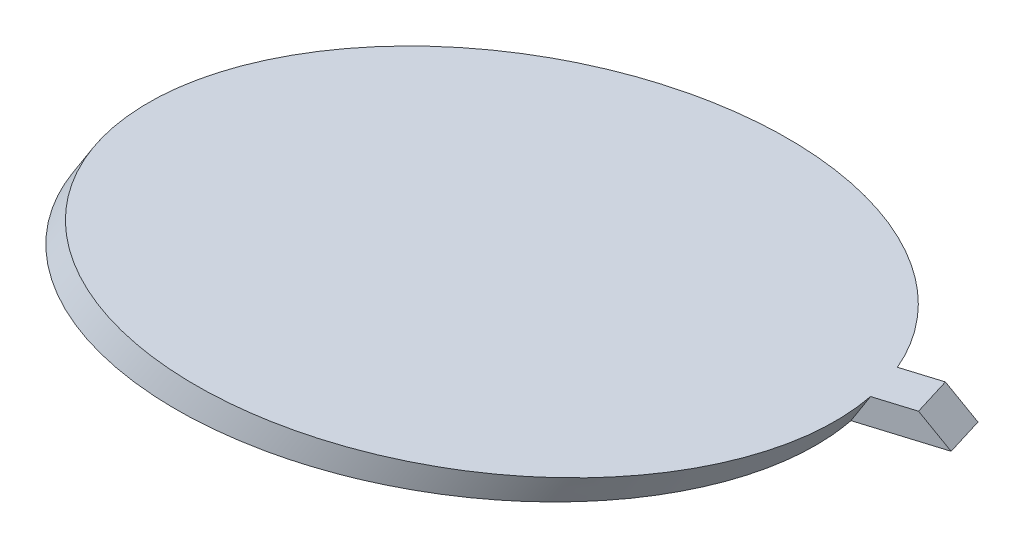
ISO-10303-21;
HEADER;
FILE_DESCRIPTION(('STEP AP214'),'2;1');
FILE_NAME('part.step','',(''),(''),'','','');
FILE_SCHEMA(('AUTOMOTIVE_DESIGN { 1 0 10303 214 1 1 1 1 }'));
ENDSEC;
DATA;
#1=APPLICATION_CONTEXT('core data for automotive mechanical design processes');
#2=APPLICATION_PROTOCOL_DEFINITION('international standard','automotive_design',2000,#1);
#3=PRODUCT_CONTEXT('',#1,'mechanical');
#4=PRODUCT('Part','Part','',(#3));
#5=PRODUCT_RELATED_PRODUCT_CATEGORY('part','',(#4));
#6=PRODUCT_DEFINITION_FORMATION('','',#4);
#7=PRODUCT_DEFINITION_CONTEXT('part definition',#1,'design');
#8=PRODUCT_DEFINITION('design','',#6,#7);
#9=PRODUCT_DEFINITION_SHAPE('','',#8);
#10=(LENGTH_UNIT() NAMED_UNIT(*) SI_UNIT(.MILLI.,.METRE.));
#11=(NAMED_UNIT(*) PLANE_ANGLE_UNIT() SI_UNIT($,.RADIAN.));
#12=(NAMED_UNIT(*) SI_UNIT($,.STERADIAN.) SOLID_ANGLE_UNIT());
#13=UNCERTAINTY_MEASURE_WITH_UNIT(LENGTH_MEASURE(1.E-05),#10,'distance_accuracy_value','');
#14=(GEOMETRIC_REPRESENTATION_CONTEXT(3) GLOBAL_UNCERTAINTY_ASSIGNED_CONTEXT((#13)) GLOBAL_UNIT_ASSIGNED_CONTEXT((#10,
#11,#12)) REPRESENTATION_CONTEXT('',''));
#15=CARTESIAN_POINT('',(0.,0.,0.));
#16=DIRECTION('',(0.,0.,1.));
#17=DIRECTION('',(1.,0.,0.));
#18=AXIS2_PLACEMENT_3D('',#15,#16,#17);
#19=CARTESIAN_POINT('',(28.7104895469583,-2.57197650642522,-6.73070158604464));
#20=CARTESIAN_POINT('',(29.0588682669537,-2.57197650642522,-4.95726979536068));
#21=CARTESIAN_POINT('',(29.1561157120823,-2.57197650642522,-3.17728620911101));
#22=CARTESIAN_POINT('',(28.9609887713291,-2.57197650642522,-0.498414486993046));
#23=CARTESIAN_POINT('',(28.8367475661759,-2.57197650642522,0.40063205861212));
#24=CARTESIAN_POINT('',(28.4825121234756,-2.57197650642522,2.15523290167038));
#25=CARTESIAN_POINT('',(28.2530117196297,-2.57197650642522,3.01589589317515));
#26=CARTESIAN_POINT('',(27.6991348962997,-2.57197650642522,4.70708800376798));
#27=CARTESIAN_POINT('',(27.3747037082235,-2.57197650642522,5.53759972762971));
#28=CARTESIAN_POINT('',(26.6357040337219,-2.57197650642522,7.16999438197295));
#29=CARTESIAN_POINT('',(26.2198064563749,-2.57197650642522,7.97301414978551));
#30=CARTESIAN_POINT('',(24.8712829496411,-2.57197650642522,10.2893901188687));
#31=CARTESIAN_POINT('',(23.8301632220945,-2.57197650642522,11.7288086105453));
#32=CARTESIAN_POINT('',(22.0849902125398,-2.57197650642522,13.7525706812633));
#33=CARTESIAN_POINT('',(21.4718438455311,-2.57197650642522,14.4051438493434));
#34=CARTESIAN_POINT('',(20.1887069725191,-2.57197650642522,15.6635424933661));
#35=CARTESIAN_POINT('',(19.5264342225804,-2.57197650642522,16.2619388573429));
#36=CARTESIAN_POINT('',(17.4821643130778,-2.57197650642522,17.9716539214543));
#37=CARTESIAN_POINT('',(16.0426543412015,-2.57197650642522,18.9974076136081));
#38=CARTESIAN_POINT('',(13.7779850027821,-2.57197650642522,20.3792221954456));
#39=CARTESIAN_POINT('',(13.005539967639,-2.57197650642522,20.8137091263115));
#40=CARTESIAN_POINT('',(11.426083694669,-2.57197650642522,21.6312569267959));
#41=CARTESIAN_POINT('',(10.6174855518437,-2.57197650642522,22.0149975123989));
#42=CARTESIAN_POINT('',(8.14939755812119,-2.57197650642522,23.0834767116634));
#43=CARTESIAN_POINT('',(6.47196864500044,-2.57197650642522,23.6761837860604));
#44=CARTESIAN_POINT('',(3.05449574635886,-2.57197650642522,24.6278195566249));
#45=CARTESIAN_POINT('',(1.31473329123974,-2.57197650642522,24.9877993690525));
#46=CARTESIAN_POINT('',(-1.34297683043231,-2.57197650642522,25.3483091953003));
#47=CARTESIAN_POINT('',(-2.237995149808,-2.57197650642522,25.4381765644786));
#48=CARTESIAN_POINT('',(-4.02023728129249,-2.57197650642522,25.5530995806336));
#49=CARTESIAN_POINT('',(-4.91040260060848,-2.57197650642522,25.5786579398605));
#50=CARTESIAN_POINT('',(-7.57793617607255,-2.57197650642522,25.5564476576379));
#51=CARTESIAN_POINT('',(-9.35235836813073,-2.57197650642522,25.4103383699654));
#52=CARTESIAN_POINT('',(-12.0075237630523,-2.57197650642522,24.9752739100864));
#53=CARTESIAN_POINT('',(-12.8866571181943,-2.57197650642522,24.7945497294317));
#54=CARTESIAN_POINT('',(-14.6174949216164,-2.57197650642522,24.361866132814));
#55=CARTESIAN_POINT('',(-15.4714792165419,-2.57197650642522,24.109572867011));
#56=CARTESIAN_POINT('',(-17.1549785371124,-2.57197650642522,23.5280526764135));
#57=CARTESIAN_POINT('',(-17.9844334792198,-2.57197650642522,23.1986368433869));
#58=CARTESIAN_POINT('',(-19.2085237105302,-2.57197650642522,22.641341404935));
#59=CARTESIAN_POINT('',(-19.6138984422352,-2.57197650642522,22.444662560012));
#60=CARTESIAN_POINT('',(-20.4105539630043,-2.57197650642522,22.0330275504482));
#61=CARTESIAN_POINT('',(-20.802573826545,-2.57197650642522,21.817777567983));
#62=CARTESIAN_POINT('',(-21.9593651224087,-2.57197650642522,21.1432148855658));
#63=CARTESIAN_POINT('',(-22.704951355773,-2.57197650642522,20.6552137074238));
#64=CARTESIAN_POINT('',(-23.7822036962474,-2.57197650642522,19.8617129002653));
#65=CARTESIAN_POINT('',(-24.1344139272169,-2.57197650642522,19.5869338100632));
#66=CARTESIAN_POINT('',(-24.8243562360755,-2.57197650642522,19.0157258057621));
#67=CARTESIAN_POINT('',(-25.163009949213,-2.57197650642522,18.7184209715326));
#68=CARTESIAN_POINT('',(-26.8057802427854,-2.57197650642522,17.1854475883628));
#69=CARTESIAN_POINT('',(-27.9502422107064,-2.57197650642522,15.821238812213));
#70=CARTESIAN_POINT('',(-29.1516319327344,-2.57197650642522,13.9298914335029));
#71=CARTESIAN_POINT('',(-29.3810848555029,-2.57197650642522,13.5406664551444));
#72=CARTESIAN_POINT('',(-29.8104566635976,-2.57197650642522,12.7523271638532));
#73=CARTESIAN_POINT('',(-30.0106847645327,-2.57197650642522,12.3529808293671));
#74=CARTESIAN_POINT('',(-30.5683411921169,-2.57197650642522,11.1395354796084));
#75=CARTESIAN_POINT('',(-30.8829111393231,-2.57197650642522,10.3100908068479));
#76=CARTESIAN_POINT('',(-31.2672265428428,-2.57197650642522,9.03457983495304));
#77=CARTESIAN_POINT('',(-31.380722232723,-2.57197650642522,8.60417852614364));
#78=CARTESIAN_POINT('',(-31.5783521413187,-2.57197650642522,7.73286288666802));
#79=CARTESIAN_POINT('',(-31.66266373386,-2.57197650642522,7.2907720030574));
#80=CARTESIAN_POINT('',(-31.8696222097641,-2.57197650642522,5.95628902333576));
#81=CARTESIAN_POINT('',(-31.9447911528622,-2.57197650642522,5.06927081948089));
#82=CARTESIAN_POINT('',(-31.9976453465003,-2.57197650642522,2.41546589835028));
#83=CARTESIAN_POINT('',(-31.8043263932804,-2.57197650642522,0.655859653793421));
#84=CARTESIAN_POINT('',(-31.184725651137,-2.57197650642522,-1.96970886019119));
#85=CARTESIAN_POINT('',(-30.9268669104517,-2.57197650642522,-2.82678704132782));
#86=CARTESIAN_POINT('',(-30.322491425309,-2.57197650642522,-4.49889521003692));
#87=CARTESIAN_POINT('',(-29.9754968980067,-2.57197650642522,-5.31564473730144));
#88=CARTESIAN_POINT('',(-29.1981313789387,-2.57197650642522,-6.9132218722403));
#89=CARTESIAN_POINT('',(-28.7677283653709,-2.57197650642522,-7.69403568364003));
#90=CARTESIAN_POINT('',(-28.0614035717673,-2.57197650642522,-8.83909567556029));
#91=CARTESIAN_POINT('',(-27.8161678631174,-2.57197650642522,-9.21572290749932));
#92=CARTESIAN_POINT('',(-27.3110140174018,-2.57197650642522,-9.95277050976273));
#93=CARTESIAN_POINT('',(-27.0505237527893,-2.57197650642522,-10.3141489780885));
#94=CARTESIAN_POINT('',(-25.7107067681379,-2.57197650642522,-12.087302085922));
#95=CARTESIAN_POINT('',(-24.5207779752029,-2.57197650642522,-13.3992088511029));
#96=CARTESIAN_POINT('',(-22.5801113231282,-2.57197650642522,-15.2264137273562));
#97=CARTESIAN_POINT('',(-21.9064343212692,-2.57197650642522,-15.8122025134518));
#98=CARTESIAN_POINT('',(-20.5093296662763,-2.57197650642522,-16.9351351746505));
#99=CARTESIAN_POINT('',(-19.7939039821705,-2.57197650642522,-17.4658752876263));
#100=CARTESIAN_POINT('',(-17.5999323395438,-2.57197650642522,-18.9712442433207));
#101=CARTESIAN_POINT('',(-16.0744961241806,-2.57197650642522,-19.860486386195));
#102=CARTESIAN_POINT('',(-13.699787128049,-2.57197650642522,-21.0367343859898));
#103=CARTESIAN_POINT('',(-12.8936656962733,-2.57197650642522,-21.4023184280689));
#104=CARTESIAN_POINT('',(-11.2522050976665,-2.57197650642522,-22.0802813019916));
#105=CARTESIAN_POINT('',(-10.4148265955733,-2.57197650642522,-22.3933347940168));
#106=CARTESIAN_POINT('',(-7.87117200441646,-2.57197650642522,-23.2453777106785));
#107=CARTESIAN_POINT('',(-6.15263868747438,-2.57197650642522,-23.6913209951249));
#108=CARTESIAN_POINT('',(-2.67175819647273,-2.57197650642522,-24.3482257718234));
#109=CARTESIAN_POINT('',(-0.909473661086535,-2.57197650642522,-24.5595232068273));
#110=CARTESIAN_POINT('',(1.76934187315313,-2.57197650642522,-24.6866730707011));
#111=CARTESIAN_POINT('',(2.66495441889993,-2.57197650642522,-24.696794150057));
#112=CARTESIAN_POINT('',(4.44432938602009,-2.57197650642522,-24.6499905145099));
#113=CARTESIAN_POINT('',(5.33061237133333,-2.57197650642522,-24.5932857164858));
#114=CARTESIAN_POINT('',(7.09623439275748,-2.57197650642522,-24.411950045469));
#115=CARTESIAN_POINT('',(7.97557503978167,-2.57197650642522,-24.2873349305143));
#116=CARTESIAN_POINT('',(9.28909667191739,-2.57197650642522,-24.0467152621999));
#117=CARTESIAN_POINT('',(9.72602029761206,-2.57197650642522,-23.9575393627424));
#118=CARTESIAN_POINT('',(10.597958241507,-2.57197650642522,-23.7605106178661));
#119=CARTESIAN_POINT('',(11.0336715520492,-2.57197650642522,-23.6524425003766));
#120=CARTESIAN_POINT('',(13.1914166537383,-2.57197650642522,-23.0675557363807));
#121=CARTESIAN_POINT('',(14.8606610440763,-2.57197650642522,-22.4564010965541));
#122=CARTESIAN_POINT('',(16.8662771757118,-2.57197650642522,-21.4888786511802));
#123=CARTESIAN_POINT('',(17.263346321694,-2.57197650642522,-21.285177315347));
#124=CARTESIAN_POINT('',(18.0490099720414,-2.57197650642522,-20.8564591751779));
#125=CARTESIAN_POINT('',(18.4380680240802,-2.57197650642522,-20.6310919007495));
#126=CARTESIAN_POINT('',(19.5806033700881,-2.57197650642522,-19.9284814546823));
#127=CARTESIAN_POINT('',(20.3131609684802,-2.57197650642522,-19.4230057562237));
#128=CARTESIAN_POINT('',(21.716817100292,-2.57197650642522,-18.3338530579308));
#129=CARTESIAN_POINT('',(22.3879515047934,-2.57197650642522,-17.7502217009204));
#130=CARTESIAN_POINT('',(23.3437649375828,-2.57197650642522,-16.8100239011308));
#131=CARTESIAN_POINT('',(23.6548392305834,-2.57197650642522,-16.4845928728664));
#132=CARTESIAN_POINT('',(24.2532798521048,-2.57197650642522,-15.8174184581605));
#133=CARTESIAN_POINT('',(24.5405322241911,-2.57197650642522,-15.476005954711));
#134=CARTESIAN_POINT('',(25.9171505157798,-2.57197650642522,-13.7299451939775));
#135=CARTESIAN_POINT('',(26.8307366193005,-2.57197650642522,-12.2103624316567));
#136=CARTESIAN_POINT('',(27.5354827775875,-2.57197650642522,-10.5542286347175));
#137=B_SPLINE_CURVE_WITH_KNOTS('',3,(#19,#20,#21,#22,#23,#24,#25,#26,#27,#28,#29,#30,#31,#32,
#33,#34,#35,#36,#37,#38,#39,#40,#41,#42,#43,#44,#45,#46,#47,#48,#49,#50,#51,#52,#53,#54,#55,#56,
#57,#58,#59,#60,#61,#62,#63,#64,#65,#66,#67,#68,#69,#70,#71,#72,#73,#74,#75,#76,#77,#78,#79,#80,
#81,#82,#83,#84,#85,#86,#87,#88,#89,#90,#91,#92,#93,#94,#95,#96,#97,#98,#99,#100,#101,#102,#103,
#104,#105,#106,#107,#108,#109,#110,#111,#112,#113,#114,#115,#116,#117,#118,#119,#120,#121,#122,
#123,#124,#125,#126,#127,#128,#129,#130,#131,#132,#133,#134,#135,#136),.UNSPECIFIED.,.F.,.F.,(4,
2,2,2,2,2,2,2,2,2,2,2,2,2,2,2,2,2,2,2,2,2,2,2,2,2,2,2,2,2,2,2,2,2,2,2,2,2,2,2,2,2,2,2,2,2,2,2,2,
2,2,2,2,2,2,2,2,2,4),(0.,0.0312499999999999,0.0468749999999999,0.0624999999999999,
0.0781249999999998,0.0937499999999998,0.125,0.140625,0.15625,0.1875,0.203124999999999,
0.218749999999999,0.249999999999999,0.281249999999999,0.296874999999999,0.312499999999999,
0.343749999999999,0.359374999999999,0.374999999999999,0.390624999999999,0.398437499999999,
0.406249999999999,0.421874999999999,0.429687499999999,0.437499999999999,0.468749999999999,
0.476562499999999,0.484374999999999,0.499999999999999,0.507812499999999,0.515624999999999,
0.531249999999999,0.562499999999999,0.578124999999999,0.593749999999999,0.609374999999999,
0.617187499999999,0.624999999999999,0.65625,0.671875,0.6875,0.71875,0.734375,0.75,0.78125,
0.8125,0.828125,0.84375,0.859375,0.8671875,0.875,0.90625,0.9140625,0.921875,0.9375,0.953125,
0.9609375,0.96875,1.),.UNSPECIFIED.);
#138=DIRECTION('',(0.492063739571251,0.857325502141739,-0.151215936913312));
#139=VECTOR('',#138,1.);
#140=SURFACE_OF_LINEAR_EXTRUSION('',#137,#139);
#141=CARTESIAN_POINT('',(30.186680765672,0.,-7.18434939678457));
#142=CARTESIAN_POINT('',(30.5350594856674,0.,-5.41091760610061));
#143=CARTESIAN_POINT('',(30.6323069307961,0.,-3.63093401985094));
#144=CARTESIAN_POINT('',(30.4371799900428,0.,-0.952062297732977));
#145=CARTESIAN_POINT('',(30.3129387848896,0.,-0.0530157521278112));
#146=CARTESIAN_POINT('',(29.9587033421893,0.,1.70158509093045));
#147=CARTESIAN_POINT('',(29.7292029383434,0.,2.56224808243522));
#148=CARTESIAN_POINT('',(29.1753261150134,0.,4.25344019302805));
#149=CARTESIAN_POINT('',(28.8508949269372,0.,5.08395191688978));
#150=CARTESIAN_POINT('',(28.1118952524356,0.,6.71634657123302));
#151=CARTESIAN_POINT('',(27.6959976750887,0.,7.51936633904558));
#152=CARTESIAN_POINT('',(26.3474741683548,0.,9.83574230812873));
#153=CARTESIAN_POINT('',(25.3063544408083,0.,11.2751607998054));
#154=CARTESIAN_POINT('',(23.5611814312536,0.,13.2989228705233));
#155=CARTESIAN_POINT('',(22.9480350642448,0.,13.9514960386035));
#156=CARTESIAN_POINT('',(21.6648981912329,0.,15.2098946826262));
#157=CARTESIAN_POINT('',(21.0026254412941,0.,15.8082910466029));
#158=CARTESIAN_POINT('',(18.9583555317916,0.,17.5180061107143));
#159=CARTESIAN_POINT('',(17.5188455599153,0.,18.5437598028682));
#160=CARTESIAN_POINT('',(15.2541762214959,0.,19.9255743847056));
#161=CARTESIAN_POINT('',(14.4817311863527,0.,20.3600613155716));
#162=CARTESIAN_POINT('',(12.9022749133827,0.,21.177609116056));
#163=CARTESIAN_POINT('',(12.0936767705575,0.,21.561349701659));
#164=CARTESIAN_POINT('',(9.62558877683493,0.,22.6298289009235));
#165=CARTESIAN_POINT('',(7.94815986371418,0.,23.2225359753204));
#166=CARTESIAN_POINT('',(4.53068696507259,0.,24.174171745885));
#167=CARTESIAN_POINT('',(2.79092450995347,0.,24.5341515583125));
#168=CARTESIAN_POINT('',(0.133214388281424,0.,24.8946613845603));
#169=CARTESIAN_POINT('',(-0.761803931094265,0.,24.9845287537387));
#170=CARTESIAN_POINT('',(-2.54404606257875,0.,25.0994517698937));
#171=CARTESIAN_POINT('',(-3.43421138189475,0.,25.1250101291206));
#172=CARTESIAN_POINT('',(-6.10174495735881,0.,25.102799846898));
#173=CARTESIAN_POINT('',(-7.87616714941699,0.,24.9566905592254));
#174=CARTESIAN_POINT('',(-10.5313325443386,0.,24.5216260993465));
#175=CARTESIAN_POINT('',(-11.4104658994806,0.,24.3409019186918));
#176=CARTESIAN_POINT('',(-13.1413037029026,0.,23.908218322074));
#177=CARTESIAN_POINT('',(-13.9952879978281,0.,23.6559250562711));
#178=CARTESIAN_POINT('',(-15.6787873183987,0.,23.0744048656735));
#179=CARTESIAN_POINT('',(-16.508242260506,0.,22.7449890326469));
#180=CARTESIAN_POINT('',(-17.7323324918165,0.,22.1876935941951));
#181=CARTESIAN_POINT('',(-18.1377072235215,0.,21.991014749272));
#182=CARTESIAN_POINT('',(-18.9343627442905,0.,21.5793797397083));
#183=CARTESIAN_POINT('',(-19.3263826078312,0.,21.3641297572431));
#184=CARTESIAN_POINT('',(-20.483173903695,0.,20.6895670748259));
#185=CARTESIAN_POINT('',(-21.2287601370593,0.,20.2015658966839));
#186=CARTESIAN_POINT('',(-22.3060124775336,0.,19.4080650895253));
#187=CARTESIAN_POINT('',(-22.6582227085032,0.,19.1332859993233));
#188=CARTESIAN_POINT('',(-23.3481650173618,0.,18.5620779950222));
#189=CARTESIAN_POINT('',(-23.6868187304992,0.,18.2647731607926));
#190=CARTESIAN_POINT('',(-25.3295890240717,0.,16.7317997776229));
#191=CARTESIAN_POINT('',(-26.4740509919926,0.,15.3675910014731));
#192=CARTESIAN_POINT('',(-27.6754407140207,0.,13.4762436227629));
#193=CARTESIAN_POINT('',(-27.9048936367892,0.,13.0870186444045));
#194=CARTESIAN_POINT('',(-28.3342654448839,0.,12.2986793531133));
#195=CARTESIAN_POINT('',(-28.534493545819,0.,11.8993330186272));
#196=CARTESIAN_POINT('',(-29.0921499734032,0.,10.6858876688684));
#197=CARTESIAN_POINT('',(-29.4067199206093,0.,9.85644299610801));
#198=CARTESIAN_POINT('',(-29.7910353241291,0.,8.58093202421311));
#199=CARTESIAN_POINT('',(-29.9045310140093,0.,8.15053071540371));
#200=CARTESIAN_POINT('',(-30.102160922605,0.,7.27921507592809));
#201=CARTESIAN_POINT('',(-30.1864725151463,0.,6.83712419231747));
#202=CARTESIAN_POINT('',(-30.3934309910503,0.,5.50264121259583));
#203=CARTESIAN_POINT('',(-30.4685999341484,0.,4.61562300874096));
#204=CARTESIAN_POINT('',(-30.5214541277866,0.,1.96181808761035));
#205=CARTESIAN_POINT('',(-30.3281351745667,0.,0.20221184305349));
#206=CARTESIAN_POINT('',(-29.7085344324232,0.,-2.42335667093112));
#207=CARTESIAN_POINT('',(-29.450675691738,0.,-3.28043485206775));
#208=CARTESIAN_POINT('',(-28.8463002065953,0.,-4.95254302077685));
#209=CARTESIAN_POINT('',(-28.499305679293,0.,-5.76929254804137));
#210=CARTESIAN_POINT('',(-27.721940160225,0.,-7.36686968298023));
#211=CARTESIAN_POINT('',(-27.2915371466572,0.,-8.14768349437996));
#212=CARTESIAN_POINT('',(-26.5852123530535,0.,-9.29274348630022));
#213=CARTESIAN_POINT('',(-26.3399766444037,0.,-9.66937071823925));
#214=CARTESIAN_POINT('',(-25.8348227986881,0.,-10.4064183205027));
#215=CARTESIAN_POINT('',(-25.5743325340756,0.,-10.7677967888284));
#216=CARTESIAN_POINT('',(-24.2345155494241,0.,-12.540949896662));
#217=CARTESIAN_POINT('',(-23.0445867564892,0.,-13.8528566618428));
#218=CARTESIAN_POINT('',(-21.1039201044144,0.,-15.6800615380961));
#219=CARTESIAN_POINT('',(-20.4302431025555,0.,-16.2658503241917));
#220=CARTESIAN_POINT('',(-19.0331384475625,0.,-17.3887829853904));
#221=CARTESIAN_POINT('',(-18.3177127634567,0.,-17.9195230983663));
#222=CARTESIAN_POINT('',(-16.1237411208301,0.,-19.4248920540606));
#223=CARTESIAN_POINT('',(-14.5983049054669,0.,-20.3141341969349));
#224=CARTESIAN_POINT('',(-12.2235959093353,0.,-21.4903821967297));
#225=CARTESIAN_POINT('',(-11.4174744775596,0.,-21.8559662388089));
#226=CARTESIAN_POINT('',(-9.77601387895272,0.,-22.5339291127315));
#227=CARTESIAN_POINT('',(-8.93863537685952,0.,-22.8469826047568));
#228=CARTESIAN_POINT('',(-6.39498078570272,0.,-23.6990255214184));
#229=CARTESIAN_POINT('',(-4.67644746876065,0.,-24.1449688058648));
#230=CARTESIAN_POINT('',(-1.19556697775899,0.,-24.8018735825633));
#231=CARTESIAN_POINT('',(0.566717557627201,0.,-25.0131710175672));
#232=CARTESIAN_POINT('',(3.24553309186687,0.,-25.1403208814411));
#233=CARTESIAN_POINT('',(4.14114563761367,0.,-25.150441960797));
#234=CARTESIAN_POINT('',(5.92052060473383,0.,-25.1036383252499));
#235=CARTESIAN_POINT('',(6.80680359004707,0.,-25.0469335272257));
#236=CARTESIAN_POINT('',(8.57242561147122,0.,-24.8655978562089));
#237=CARTESIAN_POINT('',(9.4517662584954,0.,-24.7409827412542));
#238=CARTESIAN_POINT('',(10.7652878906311,0.,-24.5003630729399));
#239=CARTESIAN_POINT('',(11.2022115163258,0.,-24.4111871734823));
#240=CARTESIAN_POINT('',(12.0741494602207,0.,-24.214158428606));
#241=CARTESIAN_POINT('',(12.5098627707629,0.,-24.1060903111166));
#242=CARTESIAN_POINT('',(14.6676078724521,0.,-23.5212035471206));
#243=CARTESIAN_POINT('',(16.33685226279,0.,-22.9100489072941));
#244=CARTESIAN_POINT('',(18.3424683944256,0.,-21.9425264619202));
#245=CARTESIAN_POINT('',(18.7395375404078,0.,-21.738825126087));
#246=CARTESIAN_POINT('',(19.5252011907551,0.,-21.3101069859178));
#247=CARTESIAN_POINT('',(19.914259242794,0.,-21.0847397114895));
#248=CARTESIAN_POINT('',(21.0567945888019,0.,-20.3821292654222));
#249=CARTESIAN_POINT('',(21.789352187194,0.,-19.8766535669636));
#250=CARTESIAN_POINT('',(23.1930083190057,0.,-18.7875008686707));
#251=CARTESIAN_POINT('',(23.8641427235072,0.,-18.2038695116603));
#252=CARTESIAN_POINT('',(24.8199561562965,0.,-17.2636717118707));
#253=CARTESIAN_POINT('',(25.1310304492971,0.,-16.9382406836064));
#254=CARTESIAN_POINT('',(25.7294710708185,0.,-16.2710662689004));
#255=CARTESIAN_POINT('',(26.0167234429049,0.,-15.9296537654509));
#256=CARTESIAN_POINT('',(27.3933417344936,0.,-14.1835930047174));
#257=CARTESIAN_POINT('',(28.3069278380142,0.,-12.6640102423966));
#258=CARTESIAN_POINT('',(29.0116739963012,0.,-11.0078764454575));
#259=B_SPLINE_CURVE_WITH_KNOTS('',3,(#141,#142,#143,#144,#145,#146,#147,#148,#149,#150,#151,
#152,#153,#154,#155,#156,#157,#158,#159,#160,#161,#162,#163,#164,#165,#166,#167,#168,#169,#170,
#171,#172,#173,#174,#175,#176,#177,#178,#179,#180,#181,#182,#183,#184,#185,#186,#187,#188,#189,
#190,#191,#192,#193,#194,#195,#196,#197,#198,#199,#200,#201,#202,#203,#204,#205,#206,#207,#208,
#209,#210,#211,#212,#213,#214,#215,#216,#217,#218,#219,#220,#221,#222,#223,#224,#225,#226,#227,
#228,#229,#230,#231,#232,#233,#234,#235,#236,#237,#238,#239,#240,#241,#242,#243,#244,#245,#246,
#247,#248,#249,#250,#251,#252,#253,#254,#255,#256,#257,#258),.UNSPECIFIED.,.F.,.F.,(4,2,2,2,2,2,
2,2,2,2,2,2,2,2,2,2,2,2,2,2,2,2,2,2,2,2,2,2,2,2,2,2,2,2,2,2,2,2,2,2,2,2,2,2,2,2,2,2,2,2,2,2,2,2,
2,2,2,2,4),(0.,0.0312499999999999,0.0468749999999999,0.0624999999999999,0.0781249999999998,
0.0937499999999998,0.125,0.140625,0.15625,0.1875,0.203124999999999,0.218749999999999,
0.249999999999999,0.281249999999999,0.296874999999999,0.312499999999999,0.343749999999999,
0.359374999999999,0.374999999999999,0.390624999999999,0.398437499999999,0.406249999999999,
0.421874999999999,0.429687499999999,0.437499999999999,0.468749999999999,0.476562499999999,
0.484374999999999,0.499999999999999,0.507812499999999,0.515624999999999,0.531249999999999,
0.562499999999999,0.578124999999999,0.593749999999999,0.609374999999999,0.617187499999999,
0.624999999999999,0.65625,0.671875,0.6875,0.71875,0.734375,0.75,0.78125,0.8125,0.828125,0.84375,
0.859375,0.8671875,0.875,0.90625,0.9140625,0.921875,0.9375,0.953125,0.9609375,0.96875,1.),.UNSPECIFIED.);
#260=CARTESIAN_POINT('',(30.186680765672,0.,-7.18434939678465));
#261=VERTEX_POINT('',#260);
#262=CARTESIAN_POINT('',(29.0116739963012,0.,-11.0078764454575));
#263=VERTEX_POINT('',#262);
#264=EDGE_CURVE('E89',#261,#263,#259,.T.);
#265=ORIENTED_EDGE('',*,*,#264,.T.);
#266=DIRECTION('',(0.492063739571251,0.857325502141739,-0.151215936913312));
#267=VECTOR('',#266,1.);
#268=CARTESIAN_POINT('',(27.5354827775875,-2.57197650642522,-10.5542286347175));
#269=LINE('',#268,#267);
#270=CARTESIAN_POINT('',(27.5354827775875,-2.57197650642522,-10.5542286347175));
#271=VERTEX_POINT('',#270);
#272=EDGE_CURVE('E46',#271,#263,#269,.T.);
#273=ORIENTED_EDGE('',*,*,#272,.F.);
#274=CARTESIAN_POINT('',(27.5354827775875,-2.57197650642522,-10.5542286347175));
#275=CARTESIAN_POINT('',(26.8307366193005,-2.57197650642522,-12.2103624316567));
#276=CARTESIAN_POINT('',(25.9171505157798,-2.57197650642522,-13.7299451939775));
#277=CARTESIAN_POINT('',(24.5405322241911,-2.57197650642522,-15.476005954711));
#278=CARTESIAN_POINT('',(24.2532798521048,-2.57197650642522,-15.8174184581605));
#279=CARTESIAN_POINT('',(23.6548392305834,-2.57197650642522,-16.4845928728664));
#280=CARTESIAN_POINT('',(23.3437649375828,-2.57197650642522,-16.8100239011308));
#281=CARTESIAN_POINT('',(22.3879515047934,-2.57197650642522,-17.7502217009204));
#282=CARTESIAN_POINT('',(21.716817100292,-2.57197650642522,-18.3338530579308));
#283=CARTESIAN_POINT('',(20.3131609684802,-2.57197650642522,-19.4230057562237));
#284=CARTESIAN_POINT('',(19.5806033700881,-2.57197650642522,-19.9284814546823));
#285=CARTESIAN_POINT('',(18.4380680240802,-2.57197650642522,-20.6310919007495));
#286=CARTESIAN_POINT('',(18.0490099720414,-2.57197650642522,-20.8564591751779));
#287=CARTESIAN_POINT('',(17.263346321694,-2.57197650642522,-21.285177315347));
#288=CARTESIAN_POINT('',(16.8662771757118,-2.57197650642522,-21.4888786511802));
#289=CARTESIAN_POINT('',(14.8606610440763,-2.57197650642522,-22.4564010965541));
#290=CARTESIAN_POINT('',(13.1914166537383,-2.57197650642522,-23.0675557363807));
#291=CARTESIAN_POINT('',(11.0336715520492,-2.57197650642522,-23.6524425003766));
#292=CARTESIAN_POINT('',(10.597958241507,-2.57197650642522,-23.7605106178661));
#293=CARTESIAN_POINT('',(9.72602029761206,-2.57197650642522,-23.9575393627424));
#294=CARTESIAN_POINT('',(9.28909667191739,-2.57197650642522,-24.0467152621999));
#295=CARTESIAN_POINT('',(7.97557503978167,-2.57197650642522,-24.2873349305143));
#296=CARTESIAN_POINT('',(7.09623439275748,-2.57197650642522,-24.411950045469));
#297=CARTESIAN_POINT('',(5.33061237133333,-2.57197650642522,-24.5932857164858));
#298=CARTESIAN_POINT('',(4.44432938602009,-2.57197650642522,-24.6499905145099));
#299=CARTESIAN_POINT('',(2.66495441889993,-2.57197650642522,-24.696794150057));
#300=CARTESIAN_POINT('',(1.76934187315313,-2.57197650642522,-24.6866730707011));
#301=CARTESIAN_POINT('',(-0.909473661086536,-2.57197650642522,-24.5595232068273));
#302=CARTESIAN_POINT('',(-2.67175819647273,-2.57197650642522,-24.3482257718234));
#303=CARTESIAN_POINT('',(-6.15263868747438,-2.57197650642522,-23.6913209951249));
#304=CARTESIAN_POINT('',(-7.87117200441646,-2.57197650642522,-23.2453777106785));
#305=CARTESIAN_POINT('',(-10.4148265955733,-2.57197650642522,-22.3933347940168));
#306=CARTESIAN_POINT('',(-11.2522050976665,-2.57197650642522,-22.0802813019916));
#307=CARTESIAN_POINT('',(-12.8936656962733,-2.57197650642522,-21.4023184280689));
#308=CARTESIAN_POINT('',(-13.699787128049,-2.57197650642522,-21.0367343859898));
#309=CARTESIAN_POINT('',(-16.0744961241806,-2.57197650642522,-19.860486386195));
#310=CARTESIAN_POINT('',(-17.5999323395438,-2.57197650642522,-18.9712442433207));
#311=CARTESIAN_POINT('',(-19.7939039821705,-2.57197650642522,-17.4658752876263));
#312=CARTESIAN_POINT('',(-20.5093296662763,-2.57197650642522,-16.9351351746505));
#313=CARTESIAN_POINT('',(-21.9064343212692,-2.57197650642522,-15.8122025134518));
#314=CARTESIAN_POINT('',(-22.5801113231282,-2.57197650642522,-15.2264137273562));
#315=CARTESIAN_POINT('',(-24.5207779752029,-2.57197650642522,-13.3992088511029));
#316=CARTESIAN_POINT('',(-25.7107067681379,-2.57197650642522,-12.087302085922));
#317=CARTESIAN_POINT('',(-27.0505237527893,-2.57197650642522,-10.3141489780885));
#318=CARTESIAN_POINT('',(-27.3110140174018,-2.57197650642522,-9.95277050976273));
#319=CARTESIAN_POINT('',(-27.8161678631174,-2.57197650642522,-9.21572290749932));
#320=CARTESIAN_POINT('',(-28.0614035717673,-2.57197650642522,-8.83909567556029));
#321=CARTESIAN_POINT('',(-28.7677283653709,-2.57197650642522,-7.69403568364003));
#322=CARTESIAN_POINT('',(-29.1981313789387,-2.57197650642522,-6.9132218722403));
#323=CARTESIAN_POINT('',(-29.9754968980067,-2.57197650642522,-5.31564473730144));
#324=CARTESIAN_POINT('',(-30.322491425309,-2.57197650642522,-4.49889521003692));
#325=CARTESIAN_POINT('',(-30.9268669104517,-2.57197650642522,-2.82678704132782));
#326=CARTESIAN_POINT('',(-31.184725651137,-2.57197650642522,-1.96970886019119));
#327=CARTESIAN_POINT('',(-31.8043263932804,-2.57197650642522,0.655859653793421));
#328=CARTESIAN_POINT('',(-31.9976453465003,-2.57197650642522,2.41546589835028));
#329=CARTESIAN_POINT('',(-31.9447911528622,-2.57197650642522,5.06927081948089));
#330=CARTESIAN_POINT('',(-31.8696222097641,-2.57197650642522,5.95628902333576));
#331=CARTESIAN_POINT('',(-31.66266373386,-2.57197650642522,7.2907720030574));
#332=CARTESIAN_POINT('',(-31.5783521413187,-2.57197650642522,7.73286288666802));
#333=CARTESIAN_POINT('',(-31.380722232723,-2.57197650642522,8.60417852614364));
#334=CARTESIAN_POINT('',(-31.2672265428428,-2.57197650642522,9.03457983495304));
#335=CARTESIAN_POINT('',(-30.8829111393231,-2.57197650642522,10.3100908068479));
#336=CARTESIAN_POINT('',(-30.5683411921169,-2.57197650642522,11.1395354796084));
#337=CARTESIAN_POINT('',(-30.0106847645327,-2.57197650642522,12.3529808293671));
#338=CARTESIAN_POINT('',(-29.8104566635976,-2.57197650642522,12.7523271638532));
#339=CARTESIAN_POINT('',(-29.3810848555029,-2.57197650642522,13.5406664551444));
#340=CARTESIAN_POINT('',(-29.1516319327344,-2.57197650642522,13.9298914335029));
#341=CARTESIAN_POINT('',(-27.9502422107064,-2.57197650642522,15.821238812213));
#342=CARTESIAN_POINT('',(-26.8057802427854,-2.57197650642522,17.1854475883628));
#343=CARTESIAN_POINT('',(-25.163009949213,-2.57197650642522,18.7184209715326));
#344=CARTESIAN_POINT('',(-24.8243562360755,-2.57197650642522,19.0157258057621));
#345=CARTESIAN_POINT('',(-24.1344139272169,-2.57197650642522,19.5869338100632));
#346=CARTESIAN_POINT('',(-23.7822036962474,-2.57197650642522,19.8617129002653));
#347=CARTESIAN_POINT('',(-22.704951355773,-2.57197650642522,20.6552137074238));
#348=CARTESIAN_POINT('',(-21.9593651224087,-2.57197650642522,21.1432148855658));
#349=CARTESIAN_POINT('',(-20.802573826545,-2.57197650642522,21.817777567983));
#350=CARTESIAN_POINT('',(-20.4105539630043,-2.57197650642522,22.0330275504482));
#351=CARTESIAN_POINT('',(-19.6138984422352,-2.57197650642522,22.444662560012));
#352=CARTESIAN_POINT('',(-19.2085237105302,-2.57197650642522,22.641341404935));
#353=CARTESIAN_POINT('',(-17.9844334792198,-2.57197650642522,23.1986368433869));
#354=CARTESIAN_POINT('',(-17.1549785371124,-2.57197650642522,23.5280526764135));
#355=CARTESIAN_POINT('',(-15.4714792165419,-2.57197650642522,24.109572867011));
#356=CARTESIAN_POINT('',(-14.6174949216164,-2.57197650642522,24.361866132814));
#357=CARTESIAN_POINT('',(-12.8866571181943,-2.57197650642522,24.7945497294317));
#358=CARTESIAN_POINT('',(-12.0075237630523,-2.57197650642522,24.9752739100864));
#359=CARTESIAN_POINT('',(-9.35235836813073,-2.57197650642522,25.4103383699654));
#360=CARTESIAN_POINT('',(-7.57793617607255,-2.57197650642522,25.5564476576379));
#361=CARTESIAN_POINT('',(-4.91040260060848,-2.57197650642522,25.5786579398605));
#362=CARTESIAN_POINT('',(-4.02023728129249,-2.57197650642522,25.5530995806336));
#363=CARTESIAN_POINT('',(-2.237995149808,-2.57197650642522,25.4381765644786));
#364=CARTESIAN_POINT('',(-1.34297683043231,-2.57197650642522,25.3483091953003));
#365=CARTESIAN_POINT('',(1.31473329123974,-2.57197650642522,24.9877993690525));
#366=CARTESIAN_POINT('',(3.05449574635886,-2.57197650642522,24.6278195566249));
#367=CARTESIAN_POINT('',(6.47196864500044,-2.57197650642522,23.6761837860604));
#368=CARTESIAN_POINT('',(8.14939755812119,-2.57197650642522,23.0834767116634));
#369=CARTESIAN_POINT('',(10.6174855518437,-2.57197650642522,22.0149975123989));
#370=CARTESIAN_POINT('',(11.426083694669,-2.57197650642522,21.6312569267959));
#371=CARTESIAN_POINT('',(13.005539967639,-2.57197650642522,20.8137091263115));
#372=CARTESIAN_POINT('',(13.7779850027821,-2.57197650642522,20.3792221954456));
#373=CARTESIAN_POINT('',(16.0426543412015,-2.57197650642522,18.9974076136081));
#374=CARTESIAN_POINT('',(17.4821643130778,-2.57197650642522,17.9716539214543));
#375=CARTESIAN_POINT('',(19.5264342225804,-2.57197650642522,16.2619388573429));
#376=CARTESIAN_POINT('',(20.1887069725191,-2.57197650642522,15.6635424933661));
#377=CARTESIAN_POINT('',(21.4718438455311,-2.57197650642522,14.4051438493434));
#378=CARTESIAN_POINT('',(22.0849902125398,-2.57197650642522,13.7525706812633));
#379=CARTESIAN_POINT('',(23.8301632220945,-2.57197650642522,11.7288086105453));
#380=CARTESIAN_POINT('',(24.8712829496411,-2.57197650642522,10.2893901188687));
#381=CARTESIAN_POINT('',(26.2198064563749,-2.57197650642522,7.97301414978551));
#382=CARTESIAN_POINT('',(26.6357040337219,-2.57197650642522,7.16999438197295));
#383=CARTESIAN_POINT('',(27.3747037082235,-2.57197650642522,5.53759972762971));
#384=CARTESIAN_POINT('',(27.6991348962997,-2.57197650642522,4.70708800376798));
#385=CARTESIAN_POINT('',(28.2530117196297,-2.57197650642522,3.01589589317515));
#386=CARTESIAN_POINT('',(28.4825121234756,-2.57197650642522,2.15523290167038));
#387=CARTESIAN_POINT('',(28.8367475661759,-2.57197650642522,0.40063205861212));
#388=CARTESIAN_POINT('',(28.9609887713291,-2.57197650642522,-0.498414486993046));
#389=CARTESIAN_POINT('',(29.1561157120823,-2.57197650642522,-3.17728620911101));
#390=CARTESIAN_POINT('',(29.0588682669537,-2.57197650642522,-4.95726979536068));
#391=CARTESIAN_POINT('',(28.7104895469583,-2.57197650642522,-6.73070158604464));
#392=B_SPLINE_CURVE_WITH_KNOTS('',3,(#274,#275,#276,#277,#278,#279,#280,#281,#282,#283,#284,
#285,#286,#287,#288,#289,#290,#291,#292,#293,#294,#295,#296,#297,#298,#299,#300,#301,#302,#303,
#304,#305,#306,#307,#308,#309,#310,#311,#312,#313,#314,#315,#316,#317,#318,#319,#320,#321,#322,
#323,#324,#325,#326,#327,#328,#329,#330,#331,#332,#333,#334,#335,#336,#337,#338,#339,#340,#341,
#342,#343,#344,#345,#346,#347,#348,#349,#350,#351,#352,#353,#354,#355,#356,#357,#358,#359,#360,
#361,#362,#363,#364,#365,#366,#367,#368,#369,#370,#371,#372,#373,#374,#375,#376,#377,#378,#379,
#380,#381,#382,#383,#384,#385,#386,#387,#388,#389,#390,#391),.UNSPECIFIED.,.F.,.F.,(4,2,2,2,2,2,
2,2,2,2,2,2,2,2,2,2,2,2,2,2,2,2,2,2,2,2,2,2,2,2,2,2,2,2,2,2,2,2,2,2,2,2,2,2,2,2,2,2,2,2,2,2,2,2,
2,2,2,2,4),(0.,0.0312499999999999,0.0390624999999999,0.0468749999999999,0.0624999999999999,
0.0781249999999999,0.0859374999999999,0.0937499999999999,0.125,0.1328125,0.140625,0.15625,
0.171875,0.1875,0.21875,0.25,0.265625,0.28125,0.3125,0.328125,0.34375,0.375000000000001,
0.382812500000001,0.390625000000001,0.406250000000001,0.421875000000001,0.437500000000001,
0.468750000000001,0.484375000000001,0.492187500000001,0.500000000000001,0.515625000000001,
0.523437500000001,0.531250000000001,0.562500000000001,0.570312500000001,0.578125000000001,
0.593750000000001,0.601562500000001,0.609375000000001,0.625000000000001,0.640625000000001,
0.656250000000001,0.687500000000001,0.703125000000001,0.718750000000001,0.750000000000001,
0.781250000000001,0.796875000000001,0.8125,0.84375,0.859375,0.875,0.90625,0.921875,0.9375,
0.953125,0.96875,1.),.UNSPECIFIED.);
#393=CARTESIAN_POINT('',(28.7104895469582,-2.57197650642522,-6.73070158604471));
#394=VERTEX_POINT('',#393);
#395=EDGE_CURVE('E84',#394,#271,#392,.F.);
#396=ORIENTED_EDGE('',*,*,#395,.F.);
#397=DIRECTION('',(0.492063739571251,0.857325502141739,-0.151215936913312));
#398=VECTOR('',#397,1.);
#399=CARTESIAN_POINT('',(28.7104895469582,-2.57197650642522,-6.73070158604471));
#400=LINE('',#399,#398);
#401=EDGE_CURVE('E78',#394,#261,#400,.T.);
#402=ORIENTED_EDGE('',*,*,#401,.T.);
#403=EDGE_LOOP('',(#265,#273,#396,#402));
#404=FACE_BOUND('',#403,.T.);
#405=ADVANCED_FACE('F37',(#404),#140,.F.);
#406=CARTESIAN_POINT('',(35.0866130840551,-2.57197650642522,-12.8747638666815));
#407=DIRECTION('',(0.293751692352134,0.,0.955881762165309));
#408=DIRECTION('',(0.955881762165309,0.,-0.293751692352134));
#409=AXIS2_PLACEMENT_3D('',#406,#407,#408);
#410=PLANE('',#409);
#411=DIRECTION('',(0.955881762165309,0.,-0.293751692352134));
#412=VECTOR('',#411,1.);
#413=CARTESIAN_POINT('',(36.5628043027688,0.,-13.3284116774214));
#414=LINE('',#413,#412);
#415=CARTESIAN_POINT('',(32.6281076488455,0.,-12.1192414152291));
#416=VERTEX_POINT('',#415);
#417=EDGE_CURVE('E85',#263,#416,#414,.T.);
#418=ORIENTED_EDGE('',*,*,#417,.T.);
#419=DIRECTION('',(0.675910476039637,-0.707106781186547,-0.207713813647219));
#420=VECTOR('',#419,1.);
#421=CARTESIAN_POINT('',(35.0866130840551,-2.57197650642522,-12.8747638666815));
#422=LINE('',#421,#420);
#423=CARTESIAN_POINT('',(35.0866130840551,-2.57197650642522,-12.8747638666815));
#424=VERTEX_POINT('',#423);
#425=EDGE_CURVE('E53',#416,#424,#422,.T.);
#426=ORIENTED_EDGE('',*,*,#425,.T.);
#427=DIRECTION('',(0.955881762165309,0.,-0.293751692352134));
#428=VECTOR('',#427,1.);
#429=CARTESIAN_POINT('',(35.0866130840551,-2.57197650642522,-12.8747638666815));
#430=LINE('',#429,#428);
#431=EDGE_CURVE('E131',#271,#424,#430,.T.);
#432=ORIENTED_EDGE('',*,*,#431,.F.);
#433=ORIENTED_EDGE('',*,*,#272,.T.);
#434=EDGE_LOOP('',(#418,#426,#432,#433));
#435=FACE_BOUND('',#434,.T.);
#436=ADVANCED_FACE('F121',(#435),#410,.F.);
#437=CARTESIAN_POINT('',(28.7104895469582,-2.57197650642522,-6.73070158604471));
#438=DIRECTION('',(-0.293751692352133,0.,-0.95588176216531));
#439=DIRECTION('',(-0.95588176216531,0.,0.293751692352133));
#440=AXIS2_PLACEMENT_3D('',#437,#438,#439);
#441=PLANE('',#440);
#442=DIRECTION('',(-0.95588176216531,0.,0.293751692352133));
#443=VECTOR('',#442,1.);
#444=CARTESIAN_POINT('',(28.7104895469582,-2.57197650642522,-6.73070158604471));
#445=LINE('',#444,#443);
#446=CARTESIAN_POINT('',(36.2616198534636,-2.57197650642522,-9.05123681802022));
#447=VERTEX_POINT('',#446);
#448=EDGE_CURVE('E61',#447,#394,#445,.T.);
#449=ORIENTED_EDGE('',*,*,#448,.F.);
#450=DIRECTION('',(-0.675910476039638,0.707106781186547,0.207713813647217));
#451=VECTOR('',#450,1.);
#452=CARTESIAN_POINT('',(32.4860547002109,1.37784794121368,-7.89096920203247));
#453=LINE('',#452,#451);
#454=CARTESIAN_POINT('',(33.8031144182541,0.,-8.29571436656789));
#455=VERTEX_POINT('',#454);
#456=EDGE_CURVE('E81',#447,#455,#453,.T.);
#457=ORIENTED_EDGE('',*,*,#456,.T.);
#458=DIRECTION('',(-0.95588176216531,0.,0.293751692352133));
#459=VECTOR('',#458,1.);
#460=CARTESIAN_POINT('',(30.186680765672,0.,-7.18434939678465));
#461=LINE('',#460,#459);
#462=EDGE_CURVE('E75',#455,#261,#461,.T.);
#463=ORIENTED_EDGE('',*,*,#462,.T.);
#464=ORIENTED_EDGE('',*,*,#401,.F.);
#465=EDGE_LOOP('',(#449,#457,#463,#464));
#466=FACE_BOUND('',#465,.T.);
#467=ADVANCED_FACE('F77',(#466),#441,.F.);
#468=CARTESIAN_POINT('',(-31.1391214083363,-2.57197650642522,9.45975015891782));
#469=DIRECTION('',(0.,-1.,0.));
#470=DIRECTION('',(0.,0.,-1.));
#471=AXIS2_PLACEMENT_3D('',#468,#469,#470);
#472=PLANE('',#471);
#473=ORIENTED_EDGE('',*,*,#395,.T.);
#474=ORIENTED_EDGE('',*,*,#431,.T.);
#475=DIRECTION('',(0.293751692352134,0.,0.955881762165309));
#476=VECTOR('',#475,1.);
#477=CARTESIAN_POINT('',(36.2616198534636,-2.57197650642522,-9.05123681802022));
#478=LINE('',#477,#476);
#479=EDGE_CURVE('E139',#424,#447,#478,.T.);
#480=ORIENTED_EDGE('',*,*,#479,.T.);
#481=ORIENTED_EDGE('',*,*,#448,.T.);
#482=EDGE_LOOP('',(#473,#474,#480,#481));
#483=FACE_BOUND('',#482,.T.);
#484=ADVANCED_FACE('F117',(#483),#472,.T.);
#485=CARTESIAN_POINT('',(-29.6629301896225,0.,9.00610234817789));
#486=DIRECTION('',(0.,-1.,0.));
#487=DIRECTION('',(0.,0.,-1.));
#488=AXIS2_PLACEMENT_3D('',#485,#486,#487);
#489=PLANE('',#488);
#490=ORIENTED_EDGE('',*,*,#462,.F.);
#491=DIRECTION('',(-0.293751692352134,0.,-0.955881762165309));
#492=VECTOR('',#491,1.);
#493=CARTESIAN_POINT('',(33.1848355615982,0.,-10.307622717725));
#494=LINE('',#493,#492);
#495=EDGE_CURVE('E11',#455,#416,#494,.T.);
#496=ORIENTED_EDGE('',*,*,#495,.T.);
#497=ORIENTED_EDGE('',*,*,#417,.F.);
#498=ORIENTED_EDGE('',*,*,#264,.F.);
#499=EDGE_LOOP('',(#490,#496,#497,#498));
#500=FACE_BOUND('',#499,.T.);
#501=ADVANCED_FACE('F94',(#500),#489,.F.);
#502=CARTESIAN_POINT('',(32.4812318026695,0.,-12.5971822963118));
#503=DIRECTION('',(-0.675910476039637,-0.707106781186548,0.207713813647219));
#504=DIRECTION('',(0.722872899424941,-0.690981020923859,0.));
#505=AXIS2_PLACEMENT_3D('',#502,#503,#504);
#506=PLANE('',#505);
#507=ORIENTED_EDGE('',*,*,#495,.F.);
#508=ORIENTED_EDGE('',*,*,#456,.F.);
#509=ORIENTED_EDGE('',*,*,#479,.F.);
#510=ORIENTED_EDGE('',*,*,#425,.F.);
#511=EDGE_LOOP('',(#507,#508,#509,#510));
#512=FACE_BOUND('',#511,.T.);
#513=ADVANCED_FACE('F116',(#512),#506,.F.);
#514=CLOSED_SHELL('',(#405,#436,#467,#484,#501,#513));
#515=MANIFOLD_SOLID_BREP('B2',#514);
#516=ADVANCED_BREP_SHAPE_REPRESENTATION('',(#18,#515),#14);
#517=SHAPE_DEFINITION_REPRESENTATION(#9,#516);
ENDSEC;
END-ISO-10303-21;
